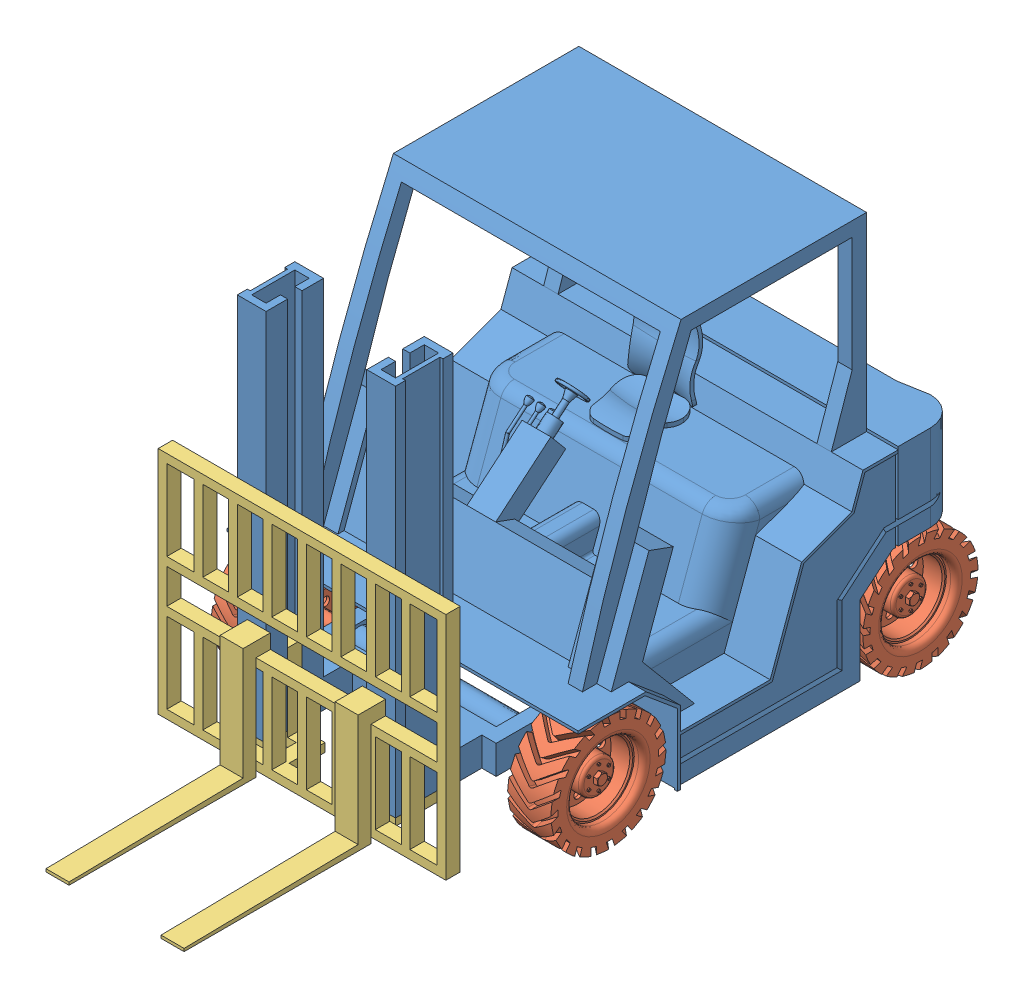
SolidWorks assembly 組合件3.sldasm, configuration 預設 (file format 10000). Lengths in mm.
Overall size (1220 1450 2410).
4 component instances, 3 part files, 6 mates.
Components (placement in the parent):
- 底盤簡化-1: 底盤簡化.SLDPRT [預設] at origin size (1220 1375 1635)
- 後輪-1: 後輪.SLDPRT [預設] at (-515 50.219 524.8928) x (0 0 1) z (-1 0 0) size (400 400 1180)
- 後輪-2: 後輪.SLDPRT [預設] at (515 50 -560) x (0 0 -1) z (1 0 0) size (400 400 1180)
- 叉子-1: 叉子.SLDPRT [預設] at (0 0 950) size (1000 820 875)
Mates (geometry in assembly coordinates):
- 同軸心1: concentric anti-aligned: cylinder of 底盤簡化-1 through (-338 50.219 524.8928) axis (1 0 0) radius 25; cylinder of 後輪-1 through (525 50.219 524.8928) axis (-1 0 0) radius 25
- 同軸心2: concentric anti-aligned: cylinder of 底盤簡化-1 through (388.1371 50 -560) axis (-1 0 0) radius 25; cylinder of 後輪-2 through (-525 50 -560) axis (1 0 0) radius 25
- 平行相距1: distance = 440 mm anti-aligned: plane of 後輪-1 through (440 50.219 524.8928) normal (-1 0 0); plane of assembly through (0 0 0) normal (1 0 0)
- 平行相距2: distance = 440 mm anti-aligned: plane of 後輪-2 through (440 50 -560) normal (-1 0 0); plane of assembly through (0 0 0) normal (1 0 0)
- 重合/共線/共點3: coincident aligned: line of 底盤簡化-1 through (500 750 950) axis (0 -1 0); line of 叉子-1 through (500 750 950) axis (0 -1 0)
- 重合/共線/共點4: coincident aligned: line of 底盤簡化-1 through (-500 750 950) axis (1 0 0); line of 叉子-1 through (-500 750 950) axis (1 0 0)
